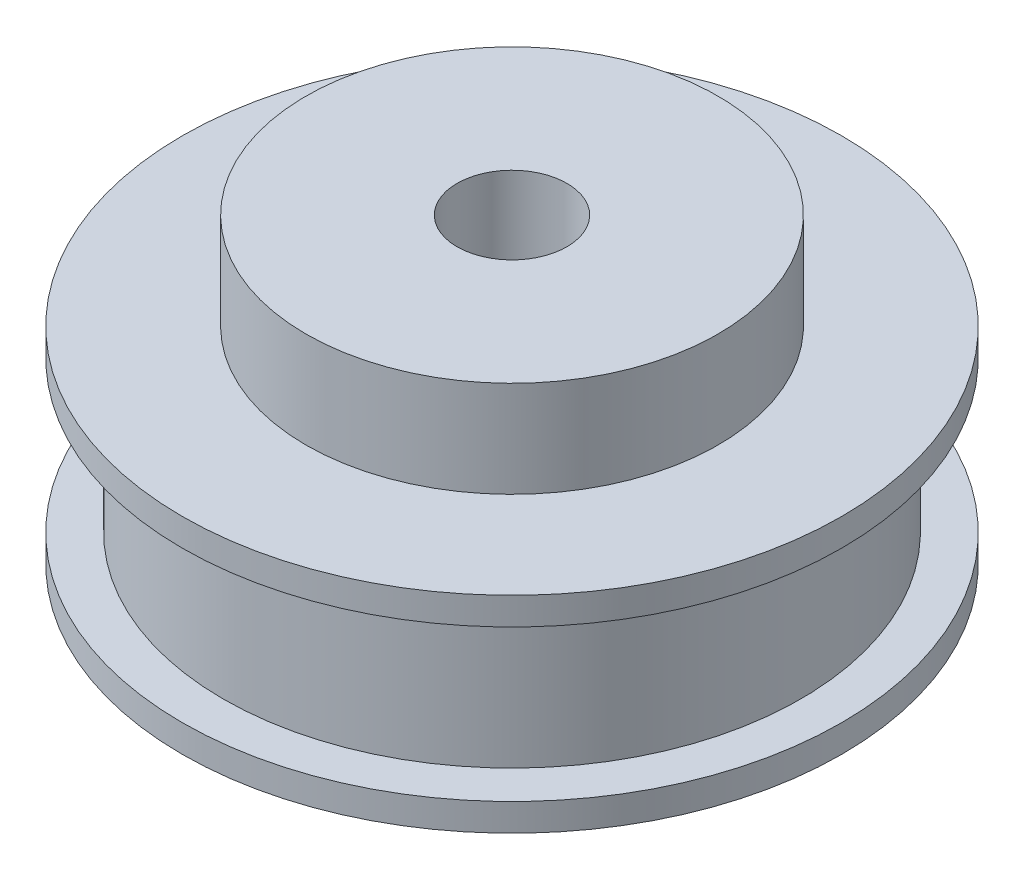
ISO-10303-21;
HEADER;
FILE_DESCRIPTION(('STEP AP214'),'2;1');
FILE_NAME('part.step','',(''),(''),'','','');
FILE_SCHEMA(('AUTOMOTIVE_DESIGN { 1 0 10303 214 1 1 1 1 }'));
ENDSEC;
DATA;
#1=APPLICATION_CONTEXT('core data for automotive mechanical design processes');
#2=APPLICATION_PROTOCOL_DEFINITION('international standard','automotive_design',2000,#1);
#3=PRODUCT_CONTEXT('',#1,'mechanical');
#4=PRODUCT('Part','Part','',(#3));
#5=PRODUCT_RELATED_PRODUCT_CATEGORY('part','',(#4));
#6=PRODUCT_DEFINITION_FORMATION('','',#4);
#7=PRODUCT_DEFINITION_CONTEXT('part definition',#1,'design');
#8=PRODUCT_DEFINITION('design','',#6,#7);
#9=PRODUCT_DEFINITION_SHAPE('','',#8);
#10=(LENGTH_UNIT() NAMED_UNIT(*) SI_UNIT(.MILLI.,.METRE.));
#11=(NAMED_UNIT(*) PLANE_ANGLE_UNIT() SI_UNIT($,.RADIAN.));
#12=(NAMED_UNIT(*) SI_UNIT($,.STERADIAN.) SOLID_ANGLE_UNIT());
#13=UNCERTAINTY_MEASURE_WITH_UNIT(LENGTH_MEASURE(1.E-05),#10,'distance_accuracy_value','');
#14=(GEOMETRIC_REPRESENTATION_CONTEXT(3) GLOBAL_UNCERTAINTY_ASSIGNED_CONTEXT((#13)) GLOBAL_UNIT_ASSIGNED_CONTEXT((#10,
#11,#12)) REPRESENTATION_CONTEXT('',''));
#15=CARTESIAN_POINT('',(0.,0.,0.));
#16=DIRECTION('',(0.,0.,1.));
#17=DIRECTION('',(1.,0.,0.));
#18=AXIS2_PLACEMENT_3D('',#15,#16,#17);
#19=CARTESIAN_POINT('',(0.,15.,0.));
#20=DIRECTION('',(0.,1.,0.));
#21=DIRECTION('',(0.,0.,1.));
#22=AXIS2_PLACEMENT_3D('',#19,#20,#21);
#23=PLANE('',#22);
#24=CARTESIAN_POINT('',(0.,15.,0.));
#25=DIRECTION('',(0.,1.,0.));
#26=DIRECTION('',(0.,0.,1.));
#27=AXIS2_PLACEMENT_3D('',#24,#25,#26);
#28=CIRCLE('',#27,24.);
#29=CARTESIAN_POINT('',(0.,15.,24.));
#30=VERTEX_POINT('',#29);
#31=EDGE_CURVE('E44',#30,#30,#28,.T.);
#32=ORIENTED_EDGE('',*,*,#31,.T.);
#33=EDGE_LOOP('',(#32));
#34=FACE_BOUND('',#33,.T.);
#35=CARTESIAN_POINT('',(0.,15.,0.));
#36=DIRECTION('',(0.,1.,0.));
#37=DIRECTION('',(0.,0.,1.));
#38=AXIS2_PLACEMENT_3D('',#35,#36,#37);
#39=CIRCLE('',#38,15.);
#40=CARTESIAN_POINT('',(0.,15.,15.));
#41=VERTEX_POINT('',#40);
#42=EDGE_CURVE('E53',#41,#41,#39,.T.);
#43=ORIENTED_EDGE('',*,*,#42,.F.);
#44=EDGE_LOOP('',(#43));
#45=FACE_BOUND('',#44,.T.);
#46=ADVANCED_FACE('F28',(#34,#45),#23,.T.);
#47=CARTESIAN_POINT('',(0.,2.,0.));
#48=DIRECTION('',(0.,1.,0.));
#49=DIRECTION('',(0.,0.,1.));
#50=AXIS2_PLACEMENT_3D('',#47,#48,#49);
#51=PLANE('',#50);
#52=CARTESIAN_POINT('',(0.,2.,0.));
#53=DIRECTION('',(0.,1.,0.));
#54=DIRECTION('',(0.,0.,1.));
#55=AXIS2_PLACEMENT_3D('',#52,#53,#54);
#56=CIRCLE('',#55,24.);
#57=CARTESIAN_POINT('',(0.,2.,24.));
#58=VERTEX_POINT('',#57);
#59=EDGE_CURVE('E10',#58,#58,#56,.T.);
#60=ORIENTED_EDGE('',*,*,#59,.T.);
#61=EDGE_LOOP('',(#60));
#62=FACE_BOUND('',#61,.T.);
#63=CARTESIAN_POINT('',(0.,2.,0.));
#64=DIRECTION('',(0.,1.,0.));
#65=DIRECTION('',(0.,0.,1.));
#66=AXIS2_PLACEMENT_3D('',#63,#64,#65);
#67=CIRCLE('',#66,21.02);
#68=CARTESIAN_POINT('',(0.,2.,21.02));
#69=VERTEX_POINT('',#68);
#70=EDGE_CURVE('E41',#69,#69,#67,.T.);
#71=ORIENTED_EDGE('',*,*,#70,.F.);
#72=EDGE_LOOP('',(#71));
#73=FACE_BOUND('',#72,.T.);
#74=ADVANCED_FACE('F88',(#62,#73),#51,.T.);
#75=CARTESIAN_POINT('',(0.,2.,0.));
#76=DIRECTION('',(0.,-1.,0.));
#77=DIRECTION('',(0.,0.,-1.));
#78=AXIS2_PLACEMENT_3D('',#75,#76,#77);
#79=CYLINDRICAL_SURFACE('',#78,24.);
#80=ORIENTED_EDGE('',*,*,#59,.F.);
#81=EDGE_LOOP('',(#80));
#82=FACE_BOUND('',#81,.T.);
#83=CARTESIAN_POINT('',(0.,0.,0.));
#84=DIRECTION('',(0.,1.,0.));
#85=DIRECTION('',(0.,0.,1.));
#86=AXIS2_PLACEMENT_3D('',#83,#84,#85);
#87=CIRCLE('',#86,24.);
#88=CARTESIAN_POINT('',(0.,0.,24.));
#89=VERTEX_POINT('',#88);
#90=EDGE_CURVE('E32',#89,#89,#87,.T.);
#91=ORIENTED_EDGE('',*,*,#90,.T.);
#92=EDGE_LOOP('',(#91));
#93=FACE_BOUND('',#92,.T.);
#94=ADVANCED_FACE('F30',(#82,#93),#79,.T.);
#95=CARTESIAN_POINT('',(0.,0.,0.));
#96=DIRECTION('',(0.,1.,0.));
#97=DIRECTION('',(0.,0.,1.));
#98=AXIS2_PLACEMENT_3D('',#95,#96,#97);
#99=PLANE('',#98);
#100=CARTESIAN_POINT('',(0.,0.,0.));
#101=DIRECTION('',(0.,1.,0.));
#102=DIRECTION('',(0.,0.,1.));
#103=AXIS2_PLACEMENT_3D('',#100,#101,#102);
#104=CIRCLE('',#103,3.99999999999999);
#105=CARTESIAN_POINT('',(0.,0.,3.99999999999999));
#106=VERTEX_POINT('',#105);
#107=EDGE_CURVE('E61',#106,#106,#104,.T.);
#108=ORIENTED_EDGE('',*,*,#107,.T.);
#109=EDGE_LOOP('',(#108));
#110=FACE_BOUND('',#109,.T.);
#111=ORIENTED_EDGE('',*,*,#90,.F.);
#112=EDGE_LOOP('',(#111));
#113=FACE_BOUND('',#112,.T.);
#114=ADVANCED_FACE('F65',(#110,#113),#99,.F.);
#115=CARTESIAN_POINT('',(0.,13.,0.));
#116=DIRECTION('',(0.,-1.,0.));
#117=DIRECTION('',(0.,0.,-1.));
#118=AXIS2_PLACEMENT_3D('',#115,#116,#117);
#119=CYLINDRICAL_SURFACE('',#118,21.02);
#120=CARTESIAN_POINT('',(0.,13.,0.));
#121=DIRECTION('',(0.,1.,0.));
#122=DIRECTION('',(0.,0.,1.));
#123=AXIS2_PLACEMENT_3D('',#120,#121,#122);
#124=CIRCLE('',#123,21.02);
#125=CARTESIAN_POINT('',(0.,13.,21.02));
#126=VERTEX_POINT('',#125);
#127=EDGE_CURVE('E39',#126,#126,#124,.T.);
#128=ORIENTED_EDGE('',*,*,#127,.F.);
#129=EDGE_LOOP('',(#128));
#130=FACE_BOUND('',#129,.T.);
#131=ORIENTED_EDGE('',*,*,#70,.T.);
#132=EDGE_LOOP('',(#131));
#133=FACE_BOUND('',#132,.T.);
#134=ADVANCED_FACE('F99',(#130,#133),#119,.T.);
#135=CARTESIAN_POINT('',(0.,13.,0.));
#136=DIRECTION('',(0.,1.,0.));
#137=DIRECTION('',(0.,0.,1.));
#138=AXIS2_PLACEMENT_3D('',#135,#136,#137);
#139=PLANE('',#138);
#140=CARTESIAN_POINT('',(0.,13.,0.));
#141=DIRECTION('',(0.,1.,0.));
#142=DIRECTION('',(0.,0.,1.));
#143=AXIS2_PLACEMENT_3D('',#140,#141,#142);
#144=CIRCLE('',#143,24.);
#145=CARTESIAN_POINT('',(0.,13.,24.));
#146=VERTEX_POINT('',#145);
#147=EDGE_CURVE('E47',#146,#146,#144,.T.);
#148=ORIENTED_EDGE('',*,*,#147,.F.);
#149=EDGE_LOOP('',(#148));
#150=FACE_BOUND('',#149,.T.);
#151=ORIENTED_EDGE('',*,*,#127,.T.);
#152=EDGE_LOOP('',(#151));
#153=FACE_BOUND('',#152,.T.);
#154=ADVANCED_FACE('F96',(#150,#153),#139,.F.);
#155=CARTESIAN_POINT('',(0.,15.,0.));
#156=DIRECTION('',(0.,-1.,0.));
#157=DIRECTION('',(0.,0.,-1.));
#158=AXIS2_PLACEMENT_3D('',#155,#156,#157);
#159=CYLINDRICAL_SURFACE('',#158,24.);
#160=ORIENTED_EDGE('',*,*,#31,.F.);
#161=EDGE_LOOP('',(#160));
#162=FACE_BOUND('',#161,.T.);
#163=ORIENTED_EDGE('',*,*,#147,.T.);
#164=EDGE_LOOP('',(#163));
#165=FACE_BOUND('',#164,.T.);
#166=ADVANCED_FACE('F83',(#162,#165),#159,.T.);
#167=CARTESIAN_POINT('',(0.,22.,0.));
#168=DIRECTION('',(0.,-1.,0.));
#169=DIRECTION('',(0.,0.,-1.));
#170=AXIS2_PLACEMENT_3D('',#167,#168,#169);
#171=CYLINDRICAL_SURFACE('',#170,15.);
#172=CARTESIAN_POINT('',(0.,22.,0.));
#173=DIRECTION('',(0.,1.,0.));
#174=DIRECTION('',(0.,0.,1.));
#175=AXIS2_PLACEMENT_3D('',#172,#173,#174);
#176=CIRCLE('',#175,15.);
#177=CARTESIAN_POINT('',(0.,22.,15.));
#178=VERTEX_POINT('',#177);
#179=EDGE_CURVE('E50',#178,#178,#176,.T.);
#180=ORIENTED_EDGE('',*,*,#179,.F.);
#181=EDGE_LOOP('',(#180));
#182=FACE_BOUND('',#181,.T.);
#183=ORIENTED_EDGE('',*,*,#42,.T.);
#184=EDGE_LOOP('',(#183));
#185=FACE_BOUND('',#184,.T.);
#186=ADVANCED_FACE('F77',(#182,#185),#171,.T.);
#187=CARTESIAN_POINT('',(0.,22.,0.));
#188=DIRECTION('',(0.,1.,0.));
#189=DIRECTION('',(0.,0.,1.));
#190=AXIS2_PLACEMENT_3D('',#187,#188,#189);
#191=PLANE('',#190);
#192=CARTESIAN_POINT('',(0.,22.,0.));
#193=DIRECTION('',(0.,1.,0.));
#194=DIRECTION('',(0.,0.,1.));
#195=AXIS2_PLACEMENT_3D('',#192,#193,#194);
#196=CIRCLE('',#195,4.);
#197=CARTESIAN_POINT('',(0.,22.,4.));
#198=VERTEX_POINT('',#197);
#199=EDGE_CURVE('E56',#198,#198,#196,.T.);
#200=ORIENTED_EDGE('',*,*,#199,.F.);
#201=EDGE_LOOP('',(#200));
#202=FACE_BOUND('',#201,.T.);
#203=ORIENTED_EDGE('',*,*,#179,.T.);
#204=EDGE_LOOP('',(#203));
#205=FACE_BOUND('',#204,.T.);
#206=ADVANCED_FACE('F71',(#202,#205),#191,.T.);
#207=CARTESIAN_POINT('',(0.,22.,0.));
#208=DIRECTION('',(0.,1.,0.));
#209=DIRECTION('',(0.,0.,1.));
#210=AXIS2_PLACEMENT_3D('',#207,#208,#209);
#211=CYLINDRICAL_SURFACE('',#210,4.);
#212=ORIENTED_EDGE('',*,*,#107,.F.);
#213=EDGE_LOOP('',(#212));
#214=FACE_BOUND('',#213,.T.);
#215=ORIENTED_EDGE('',*,*,#199,.T.);
#216=EDGE_LOOP('',(#215));
#217=FACE_BOUND('',#216,.T.);
#218=ADVANCED_FACE('F68',(#214,#217),#211,.F.);
#219=CLOSED_SHELL('',(#46,#74,#94,#114,#134,#154,#166,#186,#206,#218));
#220=MANIFOLD_SOLID_BREP('B2',#219);
#221=ADVANCED_BREP_SHAPE_REPRESENTATION('',(#18,#220),#14);
#222=SHAPE_DEFINITION_REPRESENTATION(#9,#221);
ENDSEC;
END-ISO-10303-21;
